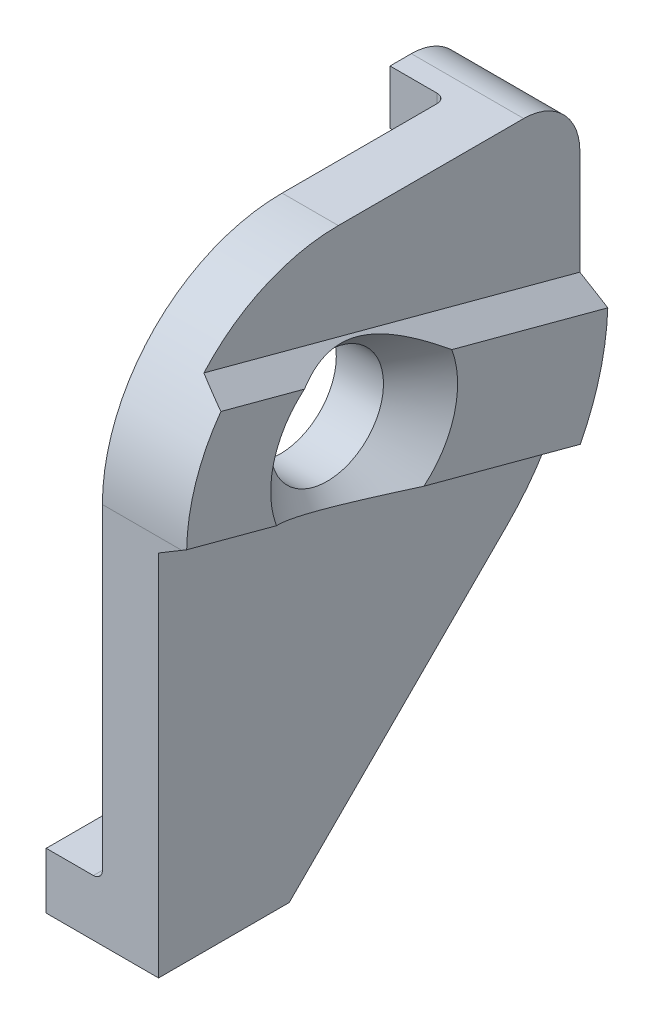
ISO-10303-21;
HEADER;
FILE_DESCRIPTION(('STEP AP214'),'2;1');
FILE_NAME('part.step','',(''),(''),'','','');
FILE_SCHEMA(('AUTOMOTIVE_DESIGN { 1 0 10303 214 1 1 1 1 }'));
ENDSEC;
DATA;
#1=APPLICATION_CONTEXT('core data for automotive mechanical design processes');
#2=APPLICATION_PROTOCOL_DEFINITION('international standard','automotive_design',2000,#1);
#3=PRODUCT_CONTEXT('',#1,'mechanical');
#4=PRODUCT('Part','Part','',(#3));
#5=PRODUCT_RELATED_PRODUCT_CATEGORY('part','',(#4));
#6=PRODUCT_DEFINITION_FORMATION('','',#4);
#7=PRODUCT_DEFINITION_CONTEXT('part definition',#1,'design');
#8=PRODUCT_DEFINITION('design','',#6,#7);
#9=PRODUCT_DEFINITION_SHAPE('','',#8);
#10=(LENGTH_UNIT() NAMED_UNIT(*) SI_UNIT(.MILLI.,.METRE.));
#11=(NAMED_UNIT(*) PLANE_ANGLE_UNIT() SI_UNIT($,.RADIAN.));
#12=(NAMED_UNIT(*) SI_UNIT($,.STERADIAN.) SOLID_ANGLE_UNIT());
#13=UNCERTAINTY_MEASURE_WITH_UNIT(LENGTH_MEASURE(1.E-05),#10,'distance_accuracy_value','');
#14=(GEOMETRIC_REPRESENTATION_CONTEXT(3) GLOBAL_UNCERTAINTY_ASSIGNED_CONTEXT((#13)) GLOBAL_UNIT_ASSIGNED_CONTEXT((#10,
#11,#12)) REPRESENTATION_CONTEXT('',''));
#15=CARTESIAN_POINT('',(0.,0.,0.));
#16=DIRECTION('',(0.,0.,1.));
#17=DIRECTION('',(1.,0.,0.));
#18=AXIS2_PLACEMENT_3D('',#15,#16,#17);
#19=CARTESIAN_POINT('',(4.7625,-0.0108948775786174,0.1905));
#20=DIRECTION('',(1.,0.,0.));
#21=DIRECTION('',(0.,0.,-1.));
#22=AXIS2_PLACEMENT_3D('',#19,#20,#21);
#23=PLANE('',#22);
#24=DIRECTION('',(0.,-0.258819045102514,-0.96592582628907));
#25=VECTOR('',#24,1.);
#26=CARTESIAN_POINT('',(4.7625,-6.37258596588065,-11.9899944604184));
#27=LINE('',#26,#25);
#28=CARTESIAN_POINT('',(4.7625,-0.471893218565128,10.0316906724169));
#29=VERTEX_POINT('',#28);
#30=CARTESIAN_POINT('',(4.7625,-1.83209046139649,4.95536545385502));
#31=VERTEX_POINT('',#30);
#32=EDGE_CURVE('E208',#29,#31,#27,.T.);
#33=ORIENTED_EDGE('',*,*,#32,.T.);
#34=CARTESIAN_POINT('',(4.7625,0.,0.));
#35=DIRECTION('',(-1.,0.,0.));
#36=DIRECTION('',(0.,0.,1.));
#37=AXIS2_PLACEMENT_3D('',#34,#35,#36);
#38=CIRCLE('',#37,5.28319999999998);
#39=CARTESIAN_POINT('',(4.7625,4.06431960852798,3.37542713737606));
#40=VERTEX_POINT('',#39);
#41=EDGE_CURVE('E196',#31,#40,#38,.T.);
#42=ORIENTED_EDGE('',*,*,#41,.T.);
#43=DIRECTION('',(0.,0.258819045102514,0.96592582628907));
#44=VECTOR('',#43,1.);
#45=CARTESIAN_POINT('',(4.7625,5.22518605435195,7.70783969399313));
#46=LINE('',#45,#44);
#47=CARTESIAN_POINT('',(4.7625,5.3296880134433,8.09784631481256));
#48=VERTEX_POINT('',#47);
#49=EDGE_CURVE('E205',#40,#48,#46,.T.);
#50=ORIENTED_EDGE('',*,*,#49,.T.);
#51=CARTESIAN_POINT('',(4.7625,-0.635,-0.127));
#52=DIRECTION('',(1.,0.,0.));
#53=DIRECTION('',(0.,0.,1.));
#54=AXIS2_PLACEMENT_3D('',#51,#52,#53);
#55=CIRCLE('',#54,10.16);
#56=EDGE_CURVE('E269',#48,#29,#55,.T.);
#57=ORIENTED_EDGE('',*,*,#56,.T.);
#58=EDGE_LOOP('',(#33,#42,#50,#57));
#59=FACE_BOUND('',#58,.T.);
#60=ADVANCED_FACE('F37',(#59),#23,.T.);
#61=CARTESIAN_POINT('',(3.175,0.,0.));
#62=DIRECTION('',(-1.,0.,0.));
#63=DIRECTION('',(0.,0.,1.));
#64=AXIS2_PLACEMENT_3D('',#61,#62,#63);
#65=CYLINDRICAL_SURFACE('',#64,3.1877);
#66=CARTESIAN_POINT('',(0.,0.,0.));
#67=DIRECTION('',(1.,0.,0.));
#68=DIRECTION('',(0.,0.,-1.));
#69=AXIS2_PLACEMENT_3D('',#66,#67,#68);
#70=CIRCLE('',#69,3.1877);
#71=CARTESIAN_POINT('',(0.,0.,-3.1877));
#72=VERTEX_POINT('',#71);
#73=EDGE_CURVE('E300',#72,#72,#70,.T.);
#74=ORIENTED_EDGE('',*,*,#73,.F.);
#75=EDGE_LOOP('',(#74));
#76=FACE_BOUND('',#75,.T.);
#77=CARTESIAN_POINT('',(2.667,0.,0.));
#78=DIRECTION('',(-1.,0.,0.));
#79=DIRECTION('',(0.,0.,1.));
#80=AXIS2_PLACEMENT_3D('',#77,#78,#79);
#81=CIRCLE('',#80,3.1877);
#82=CARTESIAN_POINT('',(2.667,0.,3.1877));
#83=VERTEX_POINT('',#82);
#84=EDGE_CURVE('E479',#83,#83,#81,.T.);
#85=ORIENTED_EDGE('',*,*,#84,.F.);
#86=EDGE_LOOP('',(#85));
#87=FACE_BOUND('',#86,.T.);
#88=ADVANCED_FACE('F368',(#76,#87),#65,.F.);
#89=DIRECTION('',(0.,0.258819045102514,0.96592582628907));
#90=VECTOR('',#89,1.);
#91=CARTESIAN_POINT('',(4.7625,5.22518605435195,7.70783969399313));
#92=LINE('',#91,#90);
#93=CARTESIAN_POINT('',(4.7625,-0.529746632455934,-13.7698614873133));
#94=VERTEX_POINT('',#93);
#95=CARTESIAN_POINT('',(4.7625,1.83209046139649,-4.95536545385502));
#96=VERTEX_POINT('',#95);
#97=EDGE_CURVE('E213',#94,#96,#92,.T.);
#98=ORIENTED_EDGE('',*,*,#97,.T.);
#99=CARTESIAN_POINT('',(4.7625,-4.06431960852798,-3.37542713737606));
#100=VERTEX_POINT('',#99);
#101=EDGE_CURVE('E57',#96,#100,#38,.T.);
#102=ORIENTED_EDGE('',*,*,#101,.T.);
#103=DIRECTION('',(0.,-0.258819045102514,-0.96592582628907));
#104=VECTOR('',#103,1.);
#105=CARTESIAN_POINT('',(4.7625,-6.37258596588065,-11.9899944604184));
#106=LINE('',#105,#104);
#107=CARTESIAN_POINT('',(4.7625,-6.43309061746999,-12.2158008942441));
#108=VERTEX_POINT('',#107);
#109=EDGE_CURVE('E216',#100,#108,#106,.T.);
#110=ORIENTED_EDGE('',*,*,#109,.T.);
#111=CARTESIAN_POINT('',(4.7625,-0.0108948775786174,0.1905));
#112=DIRECTION('',(1.,0.,0.));
#113=DIRECTION('',(0.,0.,-1.));
#114=AXIS2_PLACEMENT_3D('',#111,#112,#113);
#115=CIRCLE('',#114,13.97);
#116=EDGE_CURVE('E267',#108,#94,#115,.T.);
#117=ORIENTED_EDGE('',*,*,#116,.T.);
#118=EDGE_LOOP('',(#98,#102,#110,#117));
#119=FACE_BOUND('',#118,.T.);
#120=ADVANCED_FACE('F265',(#119),#23,.T.);
#121=CARTESIAN_POINT('',(4.7625,-2.90130985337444,0.964984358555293));
#122=DIRECTION('',(0.499999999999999,-0.83651630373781,0.224143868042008));
#123=DIRECTION('',(0.,0.258819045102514,0.96592582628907));
#124=AXIS2_PLACEMENT_3D('',#121,#122,#123);
#125=PLANE('',#124);
#126=ORIENTED_EDGE('',*,*,#109,.F.);
#127=CARTESIAN_POINT('',(4.7627,-4.06429264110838,-3.37577263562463));
#128=CARTESIAN_POINT('',(4.69811192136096,-4.07299844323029,-3.26418584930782));
#129=CARTESIAN_POINT('',(4.6346922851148,-4.08080208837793,-3.15183862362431));
#130=CARTESIAN_POINT('',(4.51053648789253,-4.09436496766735,-2.92550038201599));
#131=CARTESIAN_POINT('',(4.44980127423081,-4.10012348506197,-2.81150880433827));
#132=CARTESIAN_POINT('',(4.33107761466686,-4.1093752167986,-2.58119866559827));
#133=CARTESIAN_POINT('',(4.2731063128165,-4.11285566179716,-2.46487069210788));
#134=CARTESIAN_POINT('',(4.16073891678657,-4.11721272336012,-2.23047237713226));
#135=CARTESIAN_POINT('',(4.10634249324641,-4.11808958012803,-2.11240219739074));
#136=CARTESIAN_POINT('',(3.94728520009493,-4.11633309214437,-1.75103617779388));
#137=CARTESIAN_POINT('',(3.84900299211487,-4.10911615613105,-1.50486308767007));
#138=CARTESIAN_POINT('',(3.67467213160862,-4.07965361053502,-1.00602575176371));
#139=CARTESIAN_POINT('',(3.5985717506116,-4.05744337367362,-0.753378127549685));
#140=CARTESIAN_POINT('',(3.4988783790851,-4.00757313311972,-0.344872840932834));
#141=CARTESIAN_POINT('',(3.4664383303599,-3.98558961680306,-0.190464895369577));
#142=CARTESIAN_POINT('',(3.41276538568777,-3.93469358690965,0.119210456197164));
#143=CARTESIAN_POINT('',(3.39153341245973,-3.90578050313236,0.274477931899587));
#144=CARTESIAN_POINT('',(3.36129915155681,-3.84111112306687,0.583271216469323));
#145=CARTESIAN_POINT('',(3.35218496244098,-3.80542097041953,0.736799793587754));
#146=CARTESIAN_POINT('',(3.3462157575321,-3.72712472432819,1.04232092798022));
#147=CARTESIAN_POINT('',(3.34936011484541,-3.68451898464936,1.19431356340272));
#148=CARTESIAN_POINT('',(3.36775993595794,-3.59283719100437,1.49543000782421));
#149=CARTESIAN_POINT('',(3.38300465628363,-3.54376690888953,1.64455624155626));
#150=CARTESIAN_POINT('',(3.42495174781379,-3.43977220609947,1.93909795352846));
#151=CARTESIAN_POINT('',(3.45165501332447,-3.38484732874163,2.08451314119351));
#152=CARTESIAN_POINT('',(3.51579735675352,-3.26941718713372,2.37222131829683));
#153=CARTESIAN_POINT('',(3.55332965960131,-3.20886670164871,2.51447511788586));
#154=CARTESIAN_POINT('',(3.63780437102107,-3.08343453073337,2.79415575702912));
#155=CARTESIAN_POINT('',(3.6847466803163,-3.01855289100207,2.93158264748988));
#156=CARTESIAN_POINT('',(3.80138395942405,-2.86614659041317,3.24018674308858));
#157=CARTESIAN_POINT('',(3.87374644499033,-2.77745326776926,3.40977499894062));
#158=CARTESIAN_POINT('',(4.02952272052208,-2.59549991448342,3.74134244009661));
#159=CARTESIAN_POINT('',(4.11294439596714,-2.50223665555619,3.90331608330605));
#160=CARTESIAN_POINT('',(4.28703644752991,-2.314072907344,4.21720384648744));
#161=CARTESIAN_POINT('',(4.37753900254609,-2.21923718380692,4.36925061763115));
#162=CARTESIAN_POINT('',(4.51842710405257,-2.07517710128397,4.59260964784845));
#163=CARTESIAN_POINT('',(4.56619826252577,-2.02690216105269,4.66621056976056));
#164=CARTESIAN_POINT('',(4.66331007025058,-1.92979821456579,4.81197913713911));
#165=CARTESIAN_POINT('',(4.71265049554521,-1.88096928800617,4.88414698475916));
#166=CARTESIAN_POINT('',(4.7627,-1.83189435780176,4.95565118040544));
#167=B_SPLINE_CURVE_WITH_KNOTS('',3,(#127,#128,#129,#130,#131,#132,#133,#134,#135,#136,#137,
#138,#139,#140,#141,#142,#143,#144,#145,#146,#147,#148,#149,#150,#151,#152,#153,#154,#155,#156,
#157,#158,#159,#160,#161,#162,#163,#164,#165,#166),.UNSPECIFIED.,.F.,.F.,(4,2,2,2,2,2,2,2,2,2,2,
2,2,2,2,2,2,2,2,4),(0.,0.387680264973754,0.77549626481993,1.1654678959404,1.55540354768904,
2.34974401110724,3.14221695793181,3.61965279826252,4.09712793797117,4.57016248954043,
5.04317285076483,5.5157637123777,5.9883914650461,6.46521599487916,6.94203549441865,
7.55523142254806,8.16886695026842,8.77084454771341,9.07126973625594,9.37165224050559),.UNSPECIFIED.);
#168=EDGE_CURVE('E276',#100,#31,#167,.T.);
#169=ORIENTED_EDGE('',*,*,#168,.T.);
#170=ORIENTED_EDGE('',*,*,#32,.F.);
#171=CARTESIAN_POINT('',(9.04363347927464,-0.635,-0.127));
#172=DIRECTION('',(0.499999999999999,-0.83651630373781,0.224143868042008));
#173=DIRECTION('',(-0.866025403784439,-0.482962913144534,0.129409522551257));
#174=AXIS2_PLACEMENT_3D('',#171,#172,#173);
#175=ELLIPSE('',#174,20.32,10.16);
#176=CARTESIAN_POINT('',(4.48903008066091,-0.635000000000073,10.033));
#177=VERTEX_POINT('',#176);
#178=EDGE_CURVE('E237',#177,#29,#175,.F.);
#179=ORIENTED_EDGE('',*,*,#178,.F.);
#180=DIRECTION('',(0.85835626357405,0.513054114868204,0.));
#181=VECTOR('',#180,1.);
#182=CARTESIAN_POINT('',(3.69247119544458,-1.11111677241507,10.033));
#183=LINE('',#182,#181);
#184=CARTESIAN_POINT('',(3.175,-1.42041809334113,10.033));
#185=VERTEX_POINT('',#184);
#186=EDGE_CURVE('E64',#185,#177,#183,.T.);
#187=ORIENTED_EDGE('',*,*,#186,.F.);
#188=DIRECTION('',(0.,-0.258819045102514,-0.96592582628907));
#189=VECTOR('',#188,1.);
#190=CARTESIAN_POINT('',(3.175,-7.25789905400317,-11.7527755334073));
#191=LINE('',#190,#189);
#192=CARTESIAN_POINT('',(3.175,-7.25789905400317,-11.7527755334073));
#193=VERTEX_POINT('',#192);
#194=EDGE_CURVE('E221',#185,#193,#191,.T.);
#195=ORIENTED_EDGE('',*,*,#194,.T.);
#196=CARTESIAN_POINT('',(9.94545034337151,-0.0108948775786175,0.1905));
#197=DIRECTION('',(0.499999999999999,-0.83651630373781,0.224143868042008));
#198=DIRECTION('',(-0.866025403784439,-0.482962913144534,0.129409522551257));
#199=AXIS2_PLACEMENT_3D('',#196,#197,#198);
#200=ELLIPSE('',#199,27.94,13.97);
#201=EDGE_CURVE('E229',#108,#193,#200,.F.);
#202=ORIENTED_EDGE('',*,*,#201,.F.);
#203=EDGE_LOOP('',(#126,#169,#170,#179,#187,#195,#202));
#204=FACE_BOUND('',#203,.T.);
#205=ADVANCED_FACE('F359',(#204),#125,.T.);
#206=CARTESIAN_POINT('',(4.7625,2.99510021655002,-0.614953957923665));
#207=DIRECTION('',(0.499999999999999,0.83651630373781,-0.224143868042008));
#208=DIRECTION('',(0.,-0.258819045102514,-0.96592582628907));
#209=AXIS2_PLACEMENT_3D('',#206,#207,#208);
#210=PLANE('',#209);
#211=ORIENTED_EDGE('',*,*,#49,.F.);
#212=CARTESIAN_POINT('',(4.7627,4.06429264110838,3.37577263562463));
#213=CARTESIAN_POINT('',(4.69811192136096,4.07299844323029,3.26418584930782));
#214=CARTESIAN_POINT('',(4.6346922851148,4.08080208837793,3.15183862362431));
#215=CARTESIAN_POINT('',(4.51053648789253,4.09436496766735,2.92550038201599));
#216=CARTESIAN_POINT('',(4.44980127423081,4.10012348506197,2.81150880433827));
#217=CARTESIAN_POINT('',(4.33107761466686,4.1093752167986,2.58119866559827));
#218=CARTESIAN_POINT('',(4.2731063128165,4.11285566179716,2.46487069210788));
#219=CARTESIAN_POINT('',(4.16073891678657,4.11721272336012,2.23047237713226));
#220=CARTESIAN_POINT('',(4.1063424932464,4.11808958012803,2.11240219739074));
#221=CARTESIAN_POINT('',(3.94728520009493,4.11633309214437,1.75103617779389));
#222=CARTESIAN_POINT('',(3.84900299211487,4.10911615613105,1.50486308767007));
#223=CARTESIAN_POINT('',(3.67467213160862,4.07965361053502,1.00602575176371));
#224=CARTESIAN_POINT('',(3.5985717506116,4.05744337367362,0.753378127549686));
#225=CARTESIAN_POINT('',(3.4988783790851,4.00757313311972,0.344872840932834));
#226=CARTESIAN_POINT('',(3.4664383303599,3.98558961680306,0.190464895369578));
#227=CARTESIAN_POINT('',(3.41276538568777,3.93469358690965,-0.119210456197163));
#228=CARTESIAN_POINT('',(3.39153341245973,3.90578050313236,-0.274477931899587));
#229=CARTESIAN_POINT('',(3.36129915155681,3.84111112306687,-0.583271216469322));
#230=CARTESIAN_POINT('',(3.35218496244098,3.80542097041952,-0.736799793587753));
#231=CARTESIAN_POINT('',(3.3462157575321,3.72712472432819,-1.04232092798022));
#232=CARTESIAN_POINT('',(3.3493601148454,3.68451898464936,-1.19431356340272));
#233=CARTESIAN_POINT('',(3.36775993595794,3.59283719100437,-1.49543000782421));
#234=CARTESIAN_POINT('',(3.38300465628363,3.54376690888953,-1.64455624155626));
#235=CARTESIAN_POINT('',(3.42495174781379,3.43977220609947,-1.93909795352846));
#236=CARTESIAN_POINT('',(3.45165501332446,3.38484732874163,-2.08451314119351));
#237=CARTESIAN_POINT('',(3.51579735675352,3.26941718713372,-2.37222131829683));
#238=CARTESIAN_POINT('',(3.55332965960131,3.20886670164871,-2.51447511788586));
#239=CARTESIAN_POINT('',(3.63780437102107,3.08343453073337,-2.79415575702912));
#240=CARTESIAN_POINT('',(3.6847466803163,3.01855289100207,-2.93158264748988));
#241=CARTESIAN_POINT('',(3.80138395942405,2.86614659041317,-3.24018674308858));
#242=CARTESIAN_POINT('',(3.87374644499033,2.77745326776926,-3.40977499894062));
#243=CARTESIAN_POINT('',(4.02952272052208,2.59549991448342,-3.74134244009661));
#244=CARTESIAN_POINT('',(4.11294439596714,2.50223665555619,-3.90331608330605));
#245=CARTESIAN_POINT('',(4.2870364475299,2.314072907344,-4.21720384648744));
#246=CARTESIAN_POINT('',(4.37753900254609,2.21923718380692,-4.36925061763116));
#247=CARTESIAN_POINT('',(4.51842710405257,2.07517710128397,-4.59260964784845));
#248=CARTESIAN_POINT('',(4.56619826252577,2.02690216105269,-4.66621056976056));
#249=CARTESIAN_POINT('',(4.66331007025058,1.92979821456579,-4.81197913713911));
#250=CARTESIAN_POINT('',(4.71265049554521,1.88096928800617,-4.88414698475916));
#251=CARTESIAN_POINT('',(4.7627,1.83189435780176,-4.95565118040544));
#252=B_SPLINE_CURVE_WITH_KNOTS('',3,(#212,#213,#214,#215,#216,#217,#218,#219,#220,#221,#222,
#223,#224,#225,#226,#227,#228,#229,#230,#231,#232,#233,#234,#235,#236,#237,#238,#239,#240,#241,
#242,#243,#244,#245,#246,#247,#248,#249,#250,#251),.UNSPECIFIED.,.F.,.F.,(4,2,2,2,2,2,2,2,2,2,2,
2,2,2,2,2,2,2,2,4),(0.,0.387680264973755,0.77549626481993,1.1654678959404,1.55540354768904,
2.34974401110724,3.14221695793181,3.61965279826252,4.09712793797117,4.57016248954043,
5.04317285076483,5.5157637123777,5.98839146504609,6.46521599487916,6.94203549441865,
7.55523142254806,8.16886695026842,8.77084454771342,9.07126973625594,9.37165224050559),.UNSPECIFIED.);
#253=EDGE_CURVE('E11',#40,#96,#252,.T.);
#254=ORIENTED_EDGE('',*,*,#253,.T.);
#255=ORIENTED_EDGE('',*,*,#97,.F.);
#256=CARTESIAN_POINT('',(10.1527029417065,-0.0108948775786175,0.1905));
#257=DIRECTION('',(0.499999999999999,0.83651630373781,-0.224143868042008));
#258=DIRECTION('',(-0.866025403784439,0.482962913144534,-0.129409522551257));
#259=AXIS2_PLACEMENT_3D('',#256,#257,#258);
#260=ELLIPSE('',#259,27.9400000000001,13.97);
#261=CARTESIAN_POINT('',(3.89012326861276,-0.0108948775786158,-13.7795));
#262=VERTEX_POINT('',#261);
#263=EDGE_CURVE('E227',#262,#94,#260,.F.);
#264=ORIENTED_EDGE('',*,*,#263,.F.);
#265=DIRECTION('',(0.85835626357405,-0.513054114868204,0.));
#266=VECTOR('',#265,1.);
#267=CARTESIAN_POINT('',(3.20907927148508,0.396176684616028,-13.7795));
#268=LINE('',#267,#266);
#269=CARTESIAN_POINT('',(3.175,0.416546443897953,-13.7795));
#270=VERTEX_POINT('',#269);
#271=EDGE_CURVE('E50',#270,#262,#268,.T.);
#272=ORIENTED_EDGE('',*,*,#271,.F.);
#273=DIRECTION('',(0.,0.258819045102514,0.96592582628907));
#274=VECTOR('',#273,1.);
#275=CARTESIAN_POINT('',(3.175,6.11049914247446,7.47062076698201));
#276=LINE('',#275,#274);
#277=CARTESIAN_POINT('',(3.175,6.11049914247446,7.47062076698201));
#278=VERTEX_POINT('',#277);
#279=EDGE_CURVE('E274',#270,#278,#276,.T.);
#280=ORIENTED_EDGE('',*,*,#279,.T.);
#281=CARTESIAN_POINT('',(11.0545198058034,-0.635,-0.127));
#282=DIRECTION('',(0.499999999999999,0.83651630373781,-0.224143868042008));
#283=DIRECTION('',(-0.866025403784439,0.482962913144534,-0.129409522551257));
#284=AXIS2_PLACEMENT_3D('',#281,#282,#283);
#285=ELLIPSE('',#284,20.3200000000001,10.16);
#286=EDGE_CURVE('E212',#48,#278,#285,.F.);
#287=ORIENTED_EDGE('',*,*,#286,.F.);
#288=EDGE_LOOP('',(#211,#254,#255,#264,#272,#280,#287));
#289=FACE_BOUND('',#288,.T.);
#290=ADVANCED_FACE('F39',(#289),#210,.T.);
#291=CARTESIAN_POINT('',(3.175,-0.635,-0.127));
#292=DIRECTION('',(-1.,0.,0.));
#293=DIRECTION('',(0.,0.,1.));
#294=AXIS2_PLACEMENT_3D('',#291,#292,#293);
#295=PLANE('',#294);
#296=ORIENTED_EDGE('',*,*,#194,.F.);
#297=DIRECTION('',(0.,-1.,0.));
#298=VECTOR('',#297,1.);
#299=CARTESIAN_POINT('',(3.175,-22.225,10.033));
#300=LINE('',#299,#298);
#301=CARTESIAN_POINT('',(3.175,-22.225,10.033));
#302=VERTEX_POINT('',#301);
#303=EDGE_CURVE('E286',#185,#302,#300,.T.);
#304=ORIENTED_EDGE('',*,*,#303,.T.);
#305=DIRECTION('',(0.,0.,-1.));
#306=VECTOR('',#305,1.);
#307=CARTESIAN_POINT('',(3.175,-22.225,2.64804165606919));
#308=LINE('',#307,#306);
#309=CARTESIAN_POINT('',(3.175,-22.225,2.64804165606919));
#310=VERTEX_POINT('',#309);
#311=EDGE_CURVE('E457',#302,#310,#308,.T.);
#312=ORIENTED_EDGE('',*,*,#311,.T.);
#313=DIRECTION('',(0.,0.707106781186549,-0.707106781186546));
#314=VECTOR('',#313,1.);
#315=CARTESIAN_POINT('',(3.175,-9.88917661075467,-9.68778173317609));
#316=LINE('',#315,#314);
#317=CARTESIAN_POINT('',(3.175,-9.88917661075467,-9.68778173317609));
#318=VERTEX_POINT('',#317);
#319=EDGE_CURVE('E460',#310,#318,#316,.T.);
#320=ORIENTED_EDGE('',*,*,#319,.T.);
#321=CARTESIAN_POINT('',(3.175,-0.0108948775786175,0.1905));
#322=DIRECTION('',(1.,0.,0.));
#323=DIRECTION('',(0.,0.,1.));
#324=AXIS2_PLACEMENT_3D('',#321,#322,#323);
#325=CIRCLE('',#324,13.97);
#326=EDGE_CURVE('E463',#318,#193,#325,.T.);
#327=ORIENTED_EDGE('',*,*,#326,.T.);
#328=EDGE_LOOP('',(#296,#304,#312,#320,#327));
#329=FACE_BOUND('',#328,.T.);
#330=ADVANCED_FACE('F367',(#329),#295,.F.);
#331=ORIENTED_EDGE('',*,*,#279,.F.);
#332=DIRECTION('',(0.,1.,0.));
#333=VECTOR('',#332,1.);
#334=CARTESIAN_POINT('',(3.175,6.34999999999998,-13.7795));
#335=LINE('',#334,#333);
#336=CARTESIAN_POINT('',(3.175,6.34999999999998,-13.7795));
#337=VERTEX_POINT('',#336);
#338=EDGE_CURVE('E251',#270,#337,#335,.T.);
#339=ORIENTED_EDGE('',*,*,#338,.T.);
#340=CARTESIAN_POINT('',(3.175,6.35,-10.6045));
#341=DIRECTION('',(1.,0.,0.));
#342=DIRECTION('',(0.,0.,1.));
#343=AXIS2_PLACEMENT_3D('',#340,#341,#342);
#344=CIRCLE('',#343,3.175);
#345=CARTESIAN_POINT('',(3.175,9.525,-10.6045));
#346=VERTEX_POINT('',#345);
#347=EDGE_CURVE('E471',#337,#346,#344,.T.);
#348=ORIENTED_EDGE('',*,*,#347,.T.);
#349=DIRECTION('',(0.,0.,1.));
#350=VECTOR('',#349,1.);
#351=CARTESIAN_POINT('',(3.175,9.525,-0.127000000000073));
#352=LINE('',#351,#350);
#353=CARTESIAN_POINT('',(3.175,9.525,-0.127000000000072));
#354=VERTEX_POINT('',#353);
#355=EDGE_CURVE('E432',#346,#354,#352,.T.);
#356=ORIENTED_EDGE('',*,*,#355,.T.);
#357=CARTESIAN_POINT('',(3.175,-0.635,-0.127));
#358=DIRECTION('',(1.,0.,0.));
#359=DIRECTION('',(0.,0.,1.));
#360=AXIS2_PLACEMENT_3D('',#357,#358,#359);
#361=CIRCLE('',#360,10.16);
#362=EDGE_CURVE('E290',#354,#278,#361,.T.);
#363=ORIENTED_EDGE('',*,*,#362,.T.);
#364=EDGE_LOOP('',(#331,#339,#348,#356,#363));
#365=FACE_BOUND('',#364,.T.);
#366=ADVANCED_FACE('F405',(#365),#295,.F.);
#367=CARTESIAN_POINT('',(0.,-0.635,-0.127));
#368=DIRECTION('',(-1.,0.,0.));
#369=DIRECTION('',(0.,0.,1.));
#370=AXIS2_PLACEMENT_3D('',#367,#368,#369);
#371=PLANE('',#370);
#372=ORIENTED_EDGE('',*,*,#73,.T.);
#373=EDGE_LOOP('',(#372));
#374=FACE_BOUND('',#373,.T.);
#375=DIRECTION('',(0.,0.,-1.));
#376=VECTOR('',#375,1.);
#377=CARTESIAN_POINT('',(0.,-22.225,2.64804165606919));
#378=LINE('',#377,#376);
#379=CARTESIAN_POINT('',(0.,-22.225,5.969));
#380=VERTEX_POINT('',#379);
#381=CARTESIAN_POINT('',(0.,-22.225,2.64804165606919));
#382=VERTEX_POINT('',#381);
#383=EDGE_CURVE('E297',#380,#382,#378,.T.);
#384=ORIENTED_EDGE('',*,*,#383,.F.);
#385=DIRECTION('',(0.,-1.,0.));
#386=VECTOR('',#385,1.);
#387=CARTESIAN_POINT('',(0.,-0.635,5.969));
#388=LINE('',#387,#386);
#389=CARTESIAN_POINT('',(0.,-18.542,5.969));
#390=VERTEX_POINT('',#389);
#391=EDGE_CURVE('E321',#380,#390,#388,.F.);
#392=ORIENTED_EDGE('',*,*,#391,.T.);
#393=DIRECTION('',(0.,0.,-1.));
#394=VECTOR('',#393,1.);
#395=CARTESIAN_POINT('',(0.,-18.542,-0.127));
#396=LINE('',#395,#394);
#397=CARTESIAN_POINT('',(0.,-18.542,10.033));
#398=VERTEX_POINT('',#397);
#399=EDGE_CURVE('E319',#390,#398,#396,.F.);
#400=ORIENTED_EDGE('',*,*,#399,.T.);
#401=DIRECTION('',(0.,-1.,0.));
#402=VECTOR('',#401,1.);
#403=CARTESIAN_POINT('',(0.,-22.225,10.033));
#404=LINE('',#403,#402);
#405=CARTESIAN_POINT('',(0.,-0.635000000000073,10.033));
#406=VERTEX_POINT('',#405);
#407=EDGE_CURVE('E461',#406,#398,#404,.T.);
#408=ORIENTED_EDGE('',*,*,#407,.F.);
#409=CARTESIAN_POINT('',(0.,-0.635,-0.127));
#410=DIRECTION('',(1.,0.,0.));
#411=DIRECTION('',(0.,0.,1.));
#412=AXIS2_PLACEMENT_3D('',#409,#410,#411);
#413=CIRCLE('',#412,10.16);
#414=CARTESIAN_POINT('',(0.,9.525,-0.127000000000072));
#415=VERTEX_POINT('',#414);
#416=EDGE_CURVE('E308',#415,#406,#413,.T.);
#417=ORIENTED_EDGE('',*,*,#416,.F.);
#418=DIRECTION('',(0.,0.,1.));
#419=VECTOR('',#418,1.);
#420=CARTESIAN_POINT('',(0.,9.525,-0.127000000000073));
#421=LINE('',#420,#419);
#422=CARTESIAN_POINT('',(0.,9.525,-8.89));
#423=VERTEX_POINT('',#422);
#424=EDGE_CURVE('E305',#423,#415,#421,.T.);
#425=ORIENTED_EDGE('',*,*,#424,.F.);
#426=DIRECTION('',(0.,1.,0.));
#427=VECTOR('',#426,1.);
#428=CARTESIAN_POINT('',(0.,-0.635,-8.89));
#429=LINE('',#428,#427);
#430=CARTESIAN_POINT('',(0.,5.969,-8.89));
#431=VERTEX_POINT('',#430);
#432=EDGE_CURVE('E315',#423,#431,#429,.F.);
#433=ORIENTED_EDGE('',*,*,#432,.T.);
#434=DIRECTION('',(0.,0.,1.));
#435=VECTOR('',#434,1.);
#436=CARTESIAN_POINT('',(0.,5.969,-0.126999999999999));
#437=LINE('',#436,#435);
#438=CARTESIAN_POINT('',(0.,5.969,-13.7795));
#439=VERTEX_POINT('',#438);
#440=EDGE_CURVE('E317',#431,#439,#437,.F.);
#441=ORIENTED_EDGE('',*,*,#440,.T.);
#442=DIRECTION('',(0.,1.,0.));
#443=VECTOR('',#442,1.);
#444=CARTESIAN_POINT('',(0.,6.34999999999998,-13.7795));
#445=LINE('',#444,#443);
#446=CARTESIAN_POINT('',(0.,-0.0108948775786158,-13.7795));
#447=VERTEX_POINT('',#446);
#448=EDGE_CURVE('E303',#447,#439,#445,.T.);
#449=ORIENTED_EDGE('',*,*,#448,.F.);
#450=CARTESIAN_POINT('',(0.,-0.0108948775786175,0.1905));
#451=DIRECTION('',(1.,0.,0.));
#452=DIRECTION('',(0.,0.,1.));
#453=AXIS2_PLACEMENT_3D('',#450,#451,#452);
#454=CIRCLE('',#453,13.97);
#455=CARTESIAN_POINT('',(0.,-9.88917661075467,-9.68778173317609));
#456=VERTEX_POINT('',#455);
#457=EDGE_CURVE('E259',#456,#447,#454,.T.);
#458=ORIENTED_EDGE('',*,*,#457,.F.);
#459=DIRECTION('',(0.,0.707106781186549,-0.707106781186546));
#460=VECTOR('',#459,1.);
#461=CARTESIAN_POINT('',(0.,-9.88917661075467,-9.68778173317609));
#462=LINE('',#461,#460);
#463=EDGE_CURVE('E299',#382,#456,#462,.T.);
#464=ORIENTED_EDGE('',*,*,#463,.F.);
#465=EDGE_LOOP('',(#384,#392,#400,#408,#417,#425,#433,#441,#449,#458,#464));
#466=FACE_BOUND('',#465,.T.);
#467=ADVANCED_FACE('F407',(#374,#466),#371,.T.);
#468=CARTESIAN_POINT('',(3.175,-22.225,2.64804165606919));
#469=DIRECTION('',(0.,1.,0.));
#470=DIRECTION('',(0.,0.,1.));
#471=AXIS2_PLACEMENT_3D('',#468,#469,#470);
#472=PLANE('',#471);
#473=DIRECTION('',(-1.,0.,0.));
#474=VECTOR('',#473,1.);
#475=CARTESIAN_POINT('',(3.175,-22.225,10.033));
#476=LINE('',#475,#474);
#477=CARTESIAN_POINT('',(-3.175,-22.225,10.033));
#478=VERTEX_POINT('',#477);
#479=EDGE_CURVE('E289',#302,#478,#476,.T.);
#480=ORIENTED_EDGE('',*,*,#479,.T.);
#481=DIRECTION('',(0.,0.,1.));
#482=VECTOR('',#481,1.);
#483=CARTESIAN_POINT('',(-3.175,-22.225,10.033));
#484=LINE('',#483,#482);
#485=CARTESIAN_POINT('',(-3.175,-22.225,6.477));
#486=VERTEX_POINT('',#485);
#487=EDGE_CURVE('E767',#486,#478,#484,.T.);
#488=ORIENTED_EDGE('',*,*,#487,.F.);
#489=DIRECTION('',(1.,0.,0.));
#490=VECTOR('',#489,1.);
#491=CARTESIAN_POINT('',(-3.175,-22.225,6.477));
#492=LINE('',#491,#490);
#493=CARTESIAN_POINT('',(-0.508,-22.225,6.477));
#494=VERTEX_POINT('',#493);
#495=EDGE_CURVE('E764',#486,#494,#492,.T.);
#496=ORIENTED_EDGE('',*,*,#495,.T.);
#497=CARTESIAN_POINT('',(-0.508,-22.225,5.969));
#498=DIRECTION('',(0.,1.,0.));
#499=DIRECTION('',(0.,0.,1.));
#500=AXIS2_PLACEMENT_3D('',#497,#498,#499);
#501=CIRCLE('',#500,0.508);
#502=EDGE_CURVE('E330',#494,#380,#501,.T.);
#503=ORIENTED_EDGE('',*,*,#502,.T.);
#504=ORIENTED_EDGE('',*,*,#383,.T.);
#505=DIRECTION('',(-1.,0.,0.));
#506=VECTOR('',#505,1.);
#507=CARTESIAN_POINT('',(3.175,-22.225,2.64804165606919));
#508=LINE('',#507,#506);
#509=EDGE_CURVE('E718',#310,#382,#508,.T.);
#510=ORIENTED_EDGE('',*,*,#509,.F.);
#511=ORIENTED_EDGE('',*,*,#311,.F.);
#512=EDGE_LOOP('',(#480,#488,#496,#503,#504,#510,#511));
#513=FACE_BOUND('',#512,.T.);
#514=ADVANCED_FACE('F410',(#513),#472,.F.);
#515=CARTESIAN_POINT('',(3.175,-9.88917661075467,-9.68778173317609));
#516=DIRECTION('',(0.,0.707106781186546,0.707106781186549));
#517=DIRECTION('',(0.,-0.707106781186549,0.707106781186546));
#518=AXIS2_PLACEMENT_3D('',#515,#516,#517);
#519=PLANE('',#518);
#520=ORIENTED_EDGE('',*,*,#463,.T.);
#521=DIRECTION('',(-1.,0.,0.));
#522=VECTOR('',#521,1.);
#523=CARTESIAN_POINT('',(3.175,-9.88917661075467,-9.68778173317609));
#524=LINE('',#523,#522);
#525=EDGE_CURVE('E261',#318,#456,#524,.T.);
#526=ORIENTED_EDGE('',*,*,#525,.F.);
#527=ORIENTED_EDGE('',*,*,#319,.F.);
#528=ORIENTED_EDGE('',*,*,#509,.T.);
#529=EDGE_LOOP('',(#520,#526,#527,#528));
#530=FACE_BOUND('',#529,.T.);
#531=ADVANCED_FACE('F600',(#530),#519,.F.);
#532=CARTESIAN_POINT('',(3.175,-0.0108948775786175,0.1905));
#533=DIRECTION('',(-1.,0.,0.));
#534=DIRECTION('',(0.,0.,1.));
#535=AXIS2_PLACEMENT_3D('',#532,#533,#534);
#536=CYLINDRICAL_SURFACE('',#535,13.97);
#537=ORIENTED_EDGE('',*,*,#116,.F.);
#538=ORIENTED_EDGE('',*,*,#201,.T.);
#539=ORIENTED_EDGE('',*,*,#326,.F.);
#540=ORIENTED_EDGE('',*,*,#525,.T.);
#541=ORIENTED_EDGE('',*,*,#457,.T.);
#542=DIRECTION('',(-1.,0.,0.));
#543=VECTOR('',#542,1.);
#544=CARTESIAN_POINT('',(3.175,-0.0108948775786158,-13.7795));
#545=LINE('',#544,#543);
#546=EDGE_CURVE('E248',#262,#447,#545,.T.);
#547=ORIENTED_EDGE('',*,*,#546,.F.);
#548=ORIENTED_EDGE('',*,*,#263,.T.);
#549=EDGE_LOOP('',(#537,#538,#539,#540,#541,#547,#548));
#550=FACE_BOUND('',#549,.T.);
#551=ADVANCED_FACE('F255',(#550),#536,.T.);
#552=CARTESIAN_POINT('',(3.175,6.34999999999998,-13.7795));
#553=DIRECTION('',(0.,0.,1.));
#554=DIRECTION('',(1.,0.,0.));
#555=AXIS2_PLACEMENT_3D('',#552,#553,#554);
#556=PLANE('',#555);
#557=ORIENTED_EDGE('',*,*,#338,.F.);
#558=ORIENTED_EDGE('',*,*,#271,.T.);
#559=ORIENTED_EDGE('',*,*,#546,.T.);
#560=ORIENTED_EDGE('',*,*,#448,.T.);
#561=CARTESIAN_POINT('',(-0.508,5.969,-13.7795));
#562=DIRECTION('',(0.,0.,1.));
#563=DIRECTION('',(1.,0.,0.));
#564=AXIS2_PLACEMENT_3D('',#561,#562,#563);
#565=CIRCLE('',#564,0.508);
#566=CARTESIAN_POINT('',(-0.171989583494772,6.34999999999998,-13.7795));
#567=VERTEX_POINT('',#566);
#568=EDGE_CURVE('E334',#439,#567,#565,.T.);
#569=ORIENTED_EDGE('',*,*,#568,.T.);
#570=DIRECTION('',(-1.,0.,0.));
#571=VECTOR('',#570,1.);
#572=CARTESIAN_POINT('',(3.175,6.34999999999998,-13.7795));
#573=LINE('',#572,#571);
#574=EDGE_CURVE('E262',#337,#567,#573,.T.);
#575=ORIENTED_EDGE('',*,*,#574,.F.);
#576=EDGE_LOOP('',(#557,#558,#559,#560,#569,#575));
#577=FACE_BOUND('',#576,.T.);
#578=ADVANCED_FACE('F246',(#577),#556,.F.);
#579=CARTESIAN_POINT('',(3.175,6.35,-10.6045));
#580=DIRECTION('',(-1.,0.,0.));
#581=DIRECTION('',(0.,0.,1.));
#582=AXIS2_PLACEMENT_3D('',#579,#580,#581);
#583=CYLINDRICAL_SURFACE('',#582,3.175);
#584=ORIENTED_EDGE('',*,*,#574,.T.);
#585=CARTESIAN_POINT('',(-0.171989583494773,6.34999999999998,-13.7795));
#586=CARTESIAN_POINT('',(-0.193377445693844,6.3688958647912,-13.7794955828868));
#587=CARTESIAN_POINT('',(-0.216383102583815,6.385947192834,-13.7793307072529));
#588=CARTESIAN_POINT('',(-0.264957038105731,6.41599424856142,-13.7788509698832));
#589=CARTESIAN_POINT('',(-0.290529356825,6.42898344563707,-13.7785358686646));
#590=CARTESIAN_POINT('',(-0.343506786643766,6.4504832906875,-13.7779275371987));
#591=CARTESIAN_POINT('',(-0.370913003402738,6.45899120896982,-13.777634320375));
#592=CARTESIAN_POINT('',(-0.426704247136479,6.4712612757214,-13.777189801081));
#593=CARTESIAN_POINT('',(-0.455086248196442,6.475036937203,-13.7770380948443));
#594=CARTESIAN_POINT('',(-0.491696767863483,6.47680462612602,-13.7769665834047));
#595=CARTESIAN_POINT('',(-0.499850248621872,6.47700126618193,-13.7769585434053));
#596=CARTESIAN_POINT('',(-0.508,6.477,-13.7769589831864));
#597=B_SPLINE_CURVE_WITH_KNOTS('',3,(#585,#586,#587,#588,#589,#590,#591,#592,#593,#594,#595,
#596),.UNSPECIFIED.,.F.,.F.,(4,2,2,2,2,4),(0.,0.0855061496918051,0.171149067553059,
0.256844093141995,0.342293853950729,0.366750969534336),.UNSPECIFIED.);
#598=CARTESIAN_POINT('',(-0.508,6.477,-13.7769589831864));
#599=VERTEX_POINT('',#598);
#600=EDGE_CURVE('E218',#567,#599,#597,.T.);
#601=ORIENTED_EDGE('',*,*,#600,.T.);
#602=DIRECTION('',(1.,0.,0.));
#603=VECTOR('',#602,1.);
#604=CARTESIAN_POINT('',(-3.175,6.477,-13.7769589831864));
#605=LINE('',#604,#603);
#606=CARTESIAN_POINT('',(-3.175,6.477,-13.7769589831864));
#607=VERTEX_POINT('',#606);
#608=EDGE_CURVE('E444',#607,#599,#605,.T.);
#609=ORIENTED_EDGE('',*,*,#608,.F.);
#610=CARTESIAN_POINT('',(-3.175,6.35,-10.6045));
#611=DIRECTION('',(-1.,0.,0.));
#612=DIRECTION('',(0.,0.,1.));
#613=AXIS2_PLACEMENT_3D('',#610,#611,#612);
#614=CIRCLE('',#613,3.175);
#615=CARTESIAN_POINT('',(-3.175,9.525,-10.6045));
#616=VERTEX_POINT('',#615);
#617=EDGE_CURVE('E437',#616,#607,#614,.T.);
#618=ORIENTED_EDGE('',*,*,#617,.F.);
#619=DIRECTION('',(-1.,0.,0.));
#620=VECTOR('',#619,1.);
#621=CARTESIAN_POINT('',(3.175,9.525,-10.6045));
#622=LINE('',#621,#620);
#623=EDGE_CURVE('E426',#346,#616,#622,.T.);
#624=ORIENTED_EDGE('',*,*,#623,.F.);
#625=ORIENTED_EDGE('',*,*,#347,.F.);
#626=EDGE_LOOP('',(#584,#601,#609,#618,#624,#625));
#627=FACE_BOUND('',#626,.T.);
#628=ADVANCED_FACE('F343',(#627),#583,.T.);
#629=CARTESIAN_POINT('',(3.175,9.525,-0.127000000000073));
#630=DIRECTION('',(0.,-1.,0.));
#631=DIRECTION('',(0.,0.,-1.));
#632=AXIS2_PLACEMENT_3D('',#629,#630,#631);
#633=PLANE('',#632);
#634=ORIENTED_EDGE('',*,*,#623,.T.);
#635=DIRECTION('',(0.,0.,-1.));
#636=VECTOR('',#635,1.);
#637=CARTESIAN_POINT('',(-3.175,9.525,-9.398));
#638=LINE('',#637,#636);
#639=CARTESIAN_POINT('',(-3.175,9.525,-9.398));
#640=VERTEX_POINT('',#639);
#641=EDGE_CURVE('E429',#640,#616,#638,.T.);
#642=ORIENTED_EDGE('',*,*,#641,.F.);
#643=DIRECTION('',(1.,0.,0.));
#644=VECTOR('',#643,1.);
#645=CARTESIAN_POINT('',(-3.175,9.525,-9.398));
#646=LINE('',#645,#644);
#647=CARTESIAN_POINT('',(-0.508,9.525,-9.398));
#648=VERTEX_POINT('',#647);
#649=EDGE_CURVE('E456',#640,#648,#646,.T.);
#650=ORIENTED_EDGE('',*,*,#649,.T.);
#651=CARTESIAN_POINT('',(-0.508,9.525,-8.89));
#652=DIRECTION('',(0.,-1.,0.));
#653=DIRECTION('',(0.,0.,-1.));
#654=AXIS2_PLACEMENT_3D('',#651,#652,#653);
#655=CIRCLE('',#654,0.508);
#656=EDGE_CURVE('E214',#648,#423,#655,.T.);
#657=ORIENTED_EDGE('',*,*,#656,.T.);
#658=ORIENTED_EDGE('',*,*,#424,.T.);
#659=DIRECTION('',(-1.,0.,0.));
#660=VECTOR('',#659,1.);
#661=CARTESIAN_POINT('',(3.175,9.525,-0.127000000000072));
#662=LINE('',#661,#660);
#663=EDGE_CURVE('E435',#354,#415,#662,.T.);
#664=ORIENTED_EDGE('',*,*,#663,.F.);
#665=ORIENTED_EDGE('',*,*,#355,.F.);
#666=EDGE_LOOP('',(#634,#642,#650,#657,#658,#664,#665));
#667=FACE_BOUND('',#666,.T.);
#668=ADVANCED_FACE('F416',(#667),#633,.F.);
#669=CARTESIAN_POINT('',(3.175,-0.635,-0.127));
#670=DIRECTION('',(-1.,0.,0.));
#671=DIRECTION('',(0.,0.,1.));
#672=AXIS2_PLACEMENT_3D('',#669,#670,#671);
#673=CYLINDRICAL_SURFACE('',#672,10.16);
#674=DIRECTION('',(-1.,0.,0.));
#675=VECTOR('',#674,1.);
#676=CARTESIAN_POINT('',(3.175,-0.635000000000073,10.033));
#677=LINE('',#676,#675);
#678=EDGE_CURVE('E737',#177,#406,#677,.T.);
#679=ORIENTED_EDGE('',*,*,#678,.F.);
#680=ORIENTED_EDGE('',*,*,#178,.T.);
#681=ORIENTED_EDGE('',*,*,#56,.F.);
#682=ORIENTED_EDGE('',*,*,#286,.T.);
#683=ORIENTED_EDGE('',*,*,#362,.F.);
#684=ORIENTED_EDGE('',*,*,#663,.T.);
#685=ORIENTED_EDGE('',*,*,#416,.T.);
#686=EDGE_LOOP('',(#679,#680,#681,#682,#683,#684,#685));
#687=FACE_BOUND('',#686,.T.);
#688=ADVANCED_FACE('F414',(#687),#673,.T.);
#689=CARTESIAN_POINT('',(3.175,-22.225,10.033));
#690=DIRECTION('',(0.,0.,-1.));
#691=DIRECTION('',(-1.,0.,0.));
#692=AXIS2_PLACEMENT_3D('',#689,#690,#691);
#693=PLANE('',#692);
#694=ORIENTED_EDGE('',*,*,#303,.F.);
#695=ORIENTED_EDGE('',*,*,#186,.T.);
#696=ORIENTED_EDGE('',*,*,#678,.T.);
#697=ORIENTED_EDGE('',*,*,#407,.T.);
#698=CARTESIAN_POINT('',(-0.508,-18.542,10.033));
#699=DIRECTION('',(0.,0.,-1.));
#700=DIRECTION('',(-1.,0.,0.));
#701=AXIS2_PLACEMENT_3D('',#698,#699,#700);
#702=CIRCLE('',#701,0.508);
#703=CARTESIAN_POINT('',(-0.508,-19.05,10.033));
#704=VERTEX_POINT('',#703);
#705=EDGE_CURVE('E332',#398,#704,#702,.T.);
#706=ORIENTED_EDGE('',*,*,#705,.T.);
#707=DIRECTION('',(1.,0.,0.));
#708=VECTOR('',#707,1.);
#709=CARTESIAN_POINT('',(-3.175,-19.05,10.033));
#710=LINE('',#709,#708);
#711=CARTESIAN_POINT('',(-3.175,-19.05,10.033));
#712=VERTEX_POINT('',#711);
#713=EDGE_CURVE('E757',#712,#704,#710,.T.);
#714=ORIENTED_EDGE('',*,*,#713,.F.);
#715=DIRECTION('',(0.,1.,0.));
#716=VECTOR('',#715,1.);
#717=CARTESIAN_POINT('',(-3.175,-22.225,10.033));
#718=LINE('',#717,#716);
#719=EDGE_CURVE('E751',#478,#712,#718,.T.);
#720=ORIENTED_EDGE('',*,*,#719,.F.);
#721=ORIENTED_EDGE('',*,*,#479,.F.);
#722=EDGE_LOOP('',(#694,#695,#696,#697,#706,#714,#720,#721));
#723=FACE_BOUND('',#722,.T.);
#724=ADVANCED_FACE('F400',(#723),#693,.F.);
#725=CARTESIAN_POINT('',(-3.175,6.477,-9.398));
#726=DIRECTION('',(0.,0.,-1.));
#727=DIRECTION('',(-1.,0.,0.));
#728=AXIS2_PLACEMENT_3D('',#725,#726,#727);
#729=PLANE('',#728);
#730=DIRECTION('',(1.,0.,0.));
#731=VECTOR('',#730,1.);
#732=CARTESIAN_POINT('',(-3.175,6.477,-9.398));
#733=LINE('',#732,#731);
#734=CARTESIAN_POINT('',(-3.175,6.477,-9.398));
#735=VERTEX_POINT('',#734);
#736=CARTESIAN_POINT('',(-0.508,6.477,-9.398));
#737=VERTEX_POINT('',#736);
#738=EDGE_CURVE('E448',#735,#737,#733,.T.);
#739=ORIENTED_EDGE('',*,*,#738,.T.);
#740=DIRECTION('',(0.,1.,0.));
#741=VECTOR('',#740,1.);
#742=CARTESIAN_POINT('',(-0.508,6.477,-9.398));
#743=LINE('',#742,#741);
#744=EDGE_CURVE('E328',#737,#648,#743,.T.);
#745=ORIENTED_EDGE('',*,*,#744,.T.);
#746=ORIENTED_EDGE('',*,*,#649,.F.);
#747=DIRECTION('',(0.,1.,0.));
#748=VECTOR('',#747,1.);
#749=CARTESIAN_POINT('',(-3.175,6.477,-9.398));
#750=LINE('',#749,#748);
#751=EDGE_CURVE('E440',#735,#640,#750,.T.);
#752=ORIENTED_EDGE('',*,*,#751,.F.);
#753=EDGE_LOOP('',(#739,#745,#746,#752));
#754=FACE_BOUND('',#753,.T.);
#755=ADVANCED_FACE('F397',(#754),#729,.F.);
#756=CARTESIAN_POINT('',(-3.175,6.477,-9.398));
#757=DIRECTION('',(0.,1.,0.));
#758=DIRECTION('',(0.,0.,1.));
#759=AXIS2_PLACEMENT_3D('',#756,#757,#758);
#760=PLANE('',#759);
#761=ORIENTED_EDGE('',*,*,#608,.T.);
#762=DIRECTION('',(0.,0.,1.));
#763=VECTOR('',#762,1.);
#764=CARTESIAN_POINT('',(-0.508,6.477,-9.398));
#765=LINE('',#764,#763);
#766=EDGE_CURVE('E325',#599,#737,#765,.T.);
#767=ORIENTED_EDGE('',*,*,#766,.T.);
#768=ORIENTED_EDGE('',*,*,#738,.F.);
#769=DIRECTION('',(0.,0.,1.));
#770=VECTOR('',#769,1.);
#771=CARTESIAN_POINT('',(-3.175,6.477,-9.398));
#772=LINE('',#771,#770);
#773=EDGE_CURVE('E446',#607,#735,#772,.T.);
#774=ORIENTED_EDGE('',*,*,#773,.F.);
#775=EDGE_LOOP('',(#761,#767,#768,#774));
#776=FACE_BOUND('',#775,.T.);
#777=ADVANCED_FACE('F393',(#776),#760,.F.);
#778=CARTESIAN_POINT('',(-3.175,6.35,-10.6045));
#779=DIRECTION('',(-1.,0.,0.));
#780=DIRECTION('',(0.,0.,1.));
#781=AXIS2_PLACEMENT_3D('',#778,#779,#780);
#782=PLANE('',#781);
#783=ORIENTED_EDGE('',*,*,#751,.T.);
#784=ORIENTED_EDGE('',*,*,#641,.T.);
#785=ORIENTED_EDGE('',*,*,#617,.T.);
#786=ORIENTED_EDGE('',*,*,#773,.T.);
#787=EDGE_LOOP('',(#783,#784,#785,#786));
#788=FACE_BOUND('',#787,.T.);
#789=ADVANCED_FACE('F389',(#788),#782,.T.);
#790=CARTESIAN_POINT('',(-3.175,-19.05,10.033));
#791=DIRECTION('',(0.,-1.,0.));
#792=DIRECTION('',(0.,0.,-1.));
#793=AXIS2_PLACEMENT_3D('',#790,#791,#792);
#794=PLANE('',#793);
#795=ORIENTED_EDGE('',*,*,#713,.T.);
#796=DIRECTION('',(0.,0.,-1.));
#797=VECTOR('',#796,1.);
#798=CARTESIAN_POINT('',(-0.508,-19.05,10.033));
#799=LINE('',#798,#797);
#800=CARTESIAN_POINT('',(-0.508,-19.05,6.477));
#801=VERTEX_POINT('',#800);
#802=EDGE_CURVE('E323',#704,#801,#799,.T.);
#803=ORIENTED_EDGE('',*,*,#802,.T.);
#804=DIRECTION('',(1.,0.,0.));
#805=VECTOR('',#804,1.);
#806=CARTESIAN_POINT('',(-3.175,-19.05,6.477));
#807=LINE('',#806,#805);
#808=CARTESIAN_POINT('',(-3.175,-19.05,6.477));
#809=VERTEX_POINT('',#808);
#810=EDGE_CURVE('E759',#809,#801,#807,.T.);
#811=ORIENTED_EDGE('',*,*,#810,.F.);
#812=DIRECTION('',(0.,0.,-1.));
#813=VECTOR('',#812,1.);
#814=CARTESIAN_POINT('',(-3.175,-19.05,10.033));
#815=LINE('',#814,#813);
#816=EDGE_CURVE('E753',#712,#809,#815,.T.);
#817=ORIENTED_EDGE('',*,*,#816,.F.);
#818=EDGE_LOOP('',(#795,#803,#811,#817));
#819=FACE_BOUND('',#818,.T.);
#820=ADVANCED_FACE('F385',(#819),#794,.F.);
#821=CARTESIAN_POINT('',(-3.175,-22.225,6.477));
#822=DIRECTION('',(0.,0.,1.));
#823=DIRECTION('',(1.,0.,0.));
#824=AXIS2_PLACEMENT_3D('',#821,#822,#823);
#825=PLANE('',#824);
#826=ORIENTED_EDGE('',*,*,#810,.T.);
#827=DIRECTION('',(0.,-1.,0.));
#828=VECTOR('',#827,1.);
#829=CARTESIAN_POINT('',(-0.508,-22.225,6.477));
#830=LINE('',#829,#828);
#831=EDGE_CURVE('E313',#801,#494,#830,.T.);
#832=ORIENTED_EDGE('',*,*,#831,.T.);
#833=ORIENTED_EDGE('',*,*,#495,.F.);
#834=DIRECTION('',(0.,-1.,0.));
#835=VECTOR('',#834,1.);
#836=CARTESIAN_POINT('',(-3.175,-22.225,6.477));
#837=LINE('',#836,#835);
#838=EDGE_CURVE('E770',#809,#486,#837,.T.);
#839=ORIENTED_EDGE('',*,*,#838,.F.);
#840=EDGE_LOOP('',(#826,#832,#833,#839));
#841=FACE_BOUND('',#840,.T.);
#842=ADVANCED_FACE('F381',(#841),#825,.F.);
#843=CARTESIAN_POINT('',(-3.175,0.,0.));
#844=DIRECTION('',(-1.,0.,0.));
#845=DIRECTION('',(0.,0.,1.));
#846=AXIS2_PLACEMENT_3D('',#843,#844,#845);
#847=PLANE('',#846);
#848=ORIENTED_EDGE('',*,*,#719,.T.);
#849=ORIENTED_EDGE('',*,*,#816,.T.);
#850=ORIENTED_EDGE('',*,*,#838,.T.);
#851=ORIENTED_EDGE('',*,*,#487,.T.);
#852=EDGE_LOOP('',(#848,#849,#850,#851));
#853=FACE_BOUND('',#852,.T.);
#854=ADVANCED_FACE('F378',(#853),#847,.T.);
#855=CARTESIAN_POINT('',(-0.508,-18.542,10.033));
#856=DIRECTION('',(0.,0.,-1.));
#857=DIRECTION('',(-1.,0.,0.));
#858=AXIS2_PLACEMENT_3D('',#855,#856,#857);
#859=CYLINDRICAL_SURFACE('',#858,0.508);
#860=ORIENTED_EDGE('',*,*,#705,.F.);
#861=ORIENTED_EDGE('',*,*,#399,.F.);
#862=CARTESIAN_POINT('',(-0.508,-18.542,5.969));
#863=DIRECTION('',(0.,-0.707106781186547,-0.707106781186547));
#864=DIRECTION('',(0.,0.707106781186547,-0.707106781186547));
#865=AXIS2_PLACEMENT_3D('',#862,#863,#864);
#866=ELLIPSE('',#865,0.718420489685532,0.508);
#867=EDGE_CURVE('E748',#801,#390,#866,.F.);
#868=ORIENTED_EDGE('',*,*,#867,.F.);
#869=ORIENTED_EDGE('',*,*,#802,.F.);
#870=EDGE_LOOP('',(#860,#861,#868,#869));
#871=FACE_BOUND('',#870,.T.);
#872=ADVANCED_FACE('F354',(#871),#859,.F.);
#873=CARTESIAN_POINT('',(-0.508,-22.225,5.969));
#874=DIRECTION('',(0.,-1.,0.));
#875=DIRECTION('',(0.,0.,-1.));
#876=AXIS2_PLACEMENT_3D('',#873,#874,#875);
#877=CYLINDRICAL_SURFACE('',#876,0.508);
#878=ORIENTED_EDGE('',*,*,#867,.T.);
#879=ORIENTED_EDGE('',*,*,#391,.F.);
#880=ORIENTED_EDGE('',*,*,#502,.F.);
#881=ORIENTED_EDGE('',*,*,#831,.F.);
#882=EDGE_LOOP('',(#878,#879,#880,#881));
#883=FACE_BOUND('',#882,.T.);
#884=ADVANCED_FACE('F357',(#883),#877,.F.);
#885=CARTESIAN_POINT('',(-0.508,6.477,-8.89));
#886=DIRECTION('',(0.,1.,0.));
#887=DIRECTION('',(0.,0.,1.));
#888=AXIS2_PLACEMENT_3D('',#885,#886,#887);
#889=CYLINDRICAL_SURFACE('',#888,0.508);
#890=ORIENTED_EDGE('',*,*,#656,.F.);
#891=ORIENTED_EDGE('',*,*,#744,.F.);
#892=CARTESIAN_POINT('',(-0.508,5.969,-8.89));
#893=DIRECTION('',(0.,0.707106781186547,0.707106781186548));
#894=DIRECTION('',(0.,0.707106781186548,-0.707106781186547));
#895=AXIS2_PLACEMENT_3D('',#892,#893,#894);
#896=ELLIPSE('',#895,0.718420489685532,0.508);
#897=EDGE_CURVE('E271',#431,#737,#896,.T.);
#898=ORIENTED_EDGE('',*,*,#897,.F.);
#899=ORIENTED_EDGE('',*,*,#432,.F.);
#900=EDGE_LOOP('',(#890,#891,#898,#899));
#901=FACE_BOUND('',#900,.T.);
#902=ADVANCED_FACE('F352',(#901),#889,.F.);
#903=CARTESIAN_POINT('',(-0.508,5.969,-9.398));
#904=DIRECTION('',(0.,0.,1.));
#905=DIRECTION('',(0.,-1.,0.));
#906=AXIS2_PLACEMENT_3D('',#903,#904,#905);
#907=CYLINDRICAL_SURFACE('',#906,0.508);
#908=ORIENTED_EDGE('',*,*,#568,.F.);
#909=ORIENTED_EDGE('',*,*,#440,.F.);
#910=ORIENTED_EDGE('',*,*,#897,.T.);
#911=ORIENTED_EDGE('',*,*,#766,.F.);
#912=ORIENTED_EDGE('',*,*,#600,.F.);
#913=EDGE_LOOP('',(#908,#909,#910,#911,#912));
#914=FACE_BOUND('',#913,.T.);
#915=ADVANCED_FACE('F347',(#914),#907,.F.);
#916=CARTESIAN_POINT('',(4.7625,0.,0.));
#917=DIRECTION('',(1.,0.,0.));
#918=DIRECTION('',(0.,0.,-1.));
#919=AXIS2_PLACEMENT_3D('',#916,#917,#918);
#920=CONICAL_SURFACE('',#919,5.28319999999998,0.785398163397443);
#921=ORIENTED_EDGE('',*,*,#84,.T.);
#922=EDGE_LOOP('',(#921));
#923=FACE_BOUND('',#922,.T.);
#924=ORIENTED_EDGE('',*,*,#101,.F.);
#925=ORIENTED_EDGE('',*,*,#253,.F.);
#926=ORIENTED_EDGE('',*,*,#41,.F.);
#927=ORIENTED_EDGE('',*,*,#168,.F.);
#928=EDGE_LOOP('',(#924,#925,#926,#927));
#929=FACE_BOUND('',#928,.T.);
#930=ADVANCED_FACE('F195',(#923,#929),#920,.F.);
#931=CLOSED_SHELL('',(#60,#88,#120,#205,#290,#330,#366,#467,#514,#531,#551,#578,#628,#668,#688,
#724,#755,#777,#789,#820,#842,#854,#872,#884,#902,#915,#930));
#932=MANIFOLD_SOLID_BREP('B2',#931);
#933=ADVANCED_BREP_SHAPE_REPRESENTATION('',(#18,#932),#14);
#934=SHAPE_DEFINITION_REPRESENTATION(#9,#933);
ENDSEC;
END-ISO-10303-21;
